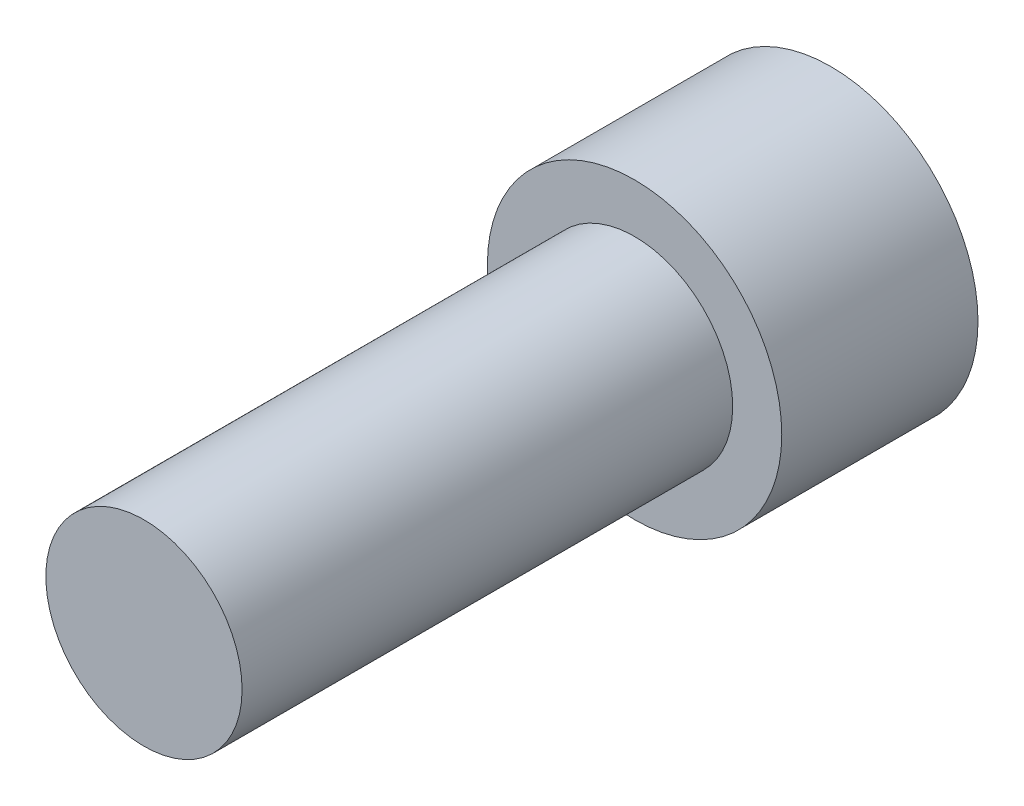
from build123d import *

# Parameters (mm, degrees)
HEX_2_DEPTH = 7.112


with BuildPart() as part:
    # Sketch6 → Revolve1 (revolve)
    with BuildSketch(Plane(origin=(0, 0, 0), x_dir=(0, 0, -1), z_dir=(1, 0, 0)), mode=Mode.PRIVATE) as revolve1_sk:
        Polygon((-31.75, 0), (-31.75, -6.35), (0, -6.35), (0, -9.525), (12.7, -9.525), (12.7, 0), align=None)
    revolve(revolve1_sk.sketch.rotate(Axis((0, 0, 31.75), (0, 0, -1)), 270), axis=Axis((0, 0, 31.75), (0, 0, -1)))

    # Sketch7 → HEX 2 (cut)
    with BuildSketch(Plane(origin=(0, 0, -12.7), x_dir=(-1, 0, 0), z_dir=(0, 0, -1))):
        Polygon((-4.7625, 2.749630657), (-4.7625, -2.749630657), (0, -5.499261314), (4.7625, -2.749630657), (4.7625, 2.749630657), (0, 5.499261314), align=None)
    extrude(amount=-HEX_2_DEPTH, mode=Mode.SUBTRACT)


solid = part.part
